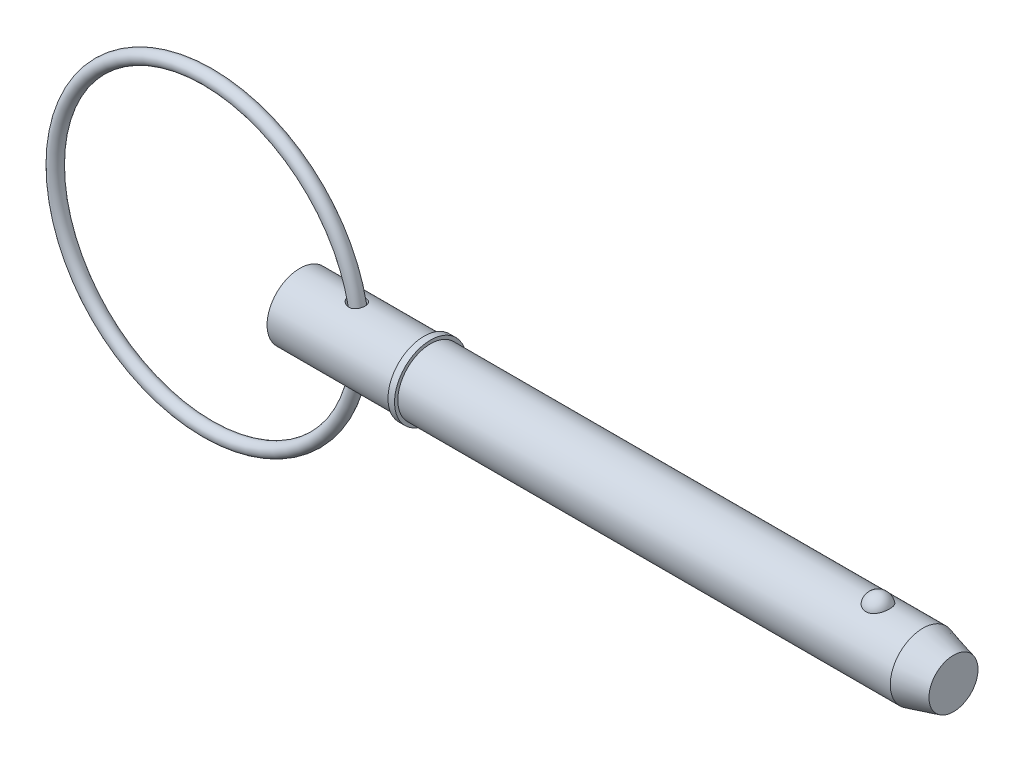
ISO-10303-21;
HEADER;
FILE_DESCRIPTION(('STEP AP214'),'2;1');
FILE_NAME('part.step','',(''),(''),'','','');
FILE_SCHEMA(('AUTOMOTIVE_DESIGN { 1 0 10303 214 1 1 1 1 }'));
ENDSEC;
DATA;
#1=APPLICATION_CONTEXT('core data for automotive mechanical design processes');
#2=APPLICATION_PROTOCOL_DEFINITION('international standard','automotive_design',2000,#1);
#3=PRODUCT_CONTEXT('',#1,'mechanical');
#4=PRODUCT('Part','Part','',(#3));
#5=PRODUCT_RELATED_PRODUCT_CATEGORY('part','',(#4));
#6=PRODUCT_DEFINITION_FORMATION('','',#4);
#7=PRODUCT_DEFINITION_CONTEXT('part definition',#1,'design');
#8=PRODUCT_DEFINITION('design','',#6,#7);
#9=PRODUCT_DEFINITION_SHAPE('','',#8);
#10=(LENGTH_UNIT() NAMED_UNIT(*) SI_UNIT(.MILLI.,.METRE.));
#11=(NAMED_UNIT(*) PLANE_ANGLE_UNIT() SI_UNIT($,.RADIAN.));
#12=(NAMED_UNIT(*) SI_UNIT($,.STERADIAN.) SOLID_ANGLE_UNIT());
#13=UNCERTAINTY_MEASURE_WITH_UNIT(LENGTH_MEASURE(1.E-05),#10,'distance_accuracy_value','');
#14=(GEOMETRIC_REPRESENTATION_CONTEXT(3) GLOBAL_UNCERTAINTY_ASSIGNED_CONTEXT((#13)) GLOBAL_UNIT_ASSIGNED_CONTEXT((#10,
#11,#12)) REPRESENTATION_CONTEXT('',''));
#15=CARTESIAN_POINT('',(0.,0.,0.));
#16=DIRECTION('',(0.,0.,1.));
#17=DIRECTION('',(1.,0.,0.));
#18=AXIS2_PLACEMENT_3D('',#15,#16,#17);
#19=CARTESIAN_POINT('',(-13.4013067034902,0.,0.));
#20=DIRECTION('',(0.,0.,1.));
#21=DIRECTION('',(1.,0.,0.));
#22=AXIS2_PLACEMENT_3D('',#19,#20,#21);
#23=TOROIDAL_SURFACE('',#22,22.225,0.952999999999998);
#24=CARTESIAN_POINT('',(9.77669329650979,0.,0.));
#25=VERTEX_POINT('',#24);
#26=VERTEX_LOOP('',#25);
#27=FACE_BOUND('',#26,.T.);
#28=ADVANCED_FACE('P0_F12',(#27),#23,.T.);
#29=CLOSED_SHELL('',(#28));
#30=MANIFOLD_SOLID_BREP('P0_B1',#29);
#31=CARTESIAN_POINT('',(0.,0.,0.));
#32=DIRECTION('',(1.,0.,0.));
#33=DIRECTION('',(0.,0.,-1.));
#34=AXIS2_PLACEMENT_3D('',#31,#32,#33);
#35=CYLINDRICAL_SURFACE('',#34,4.765);
#36=CARTESIAN_POINT('',(7.48459594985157,4.685973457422,-0.864220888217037));
#37=CARTESIAN_POINT('',(7.53849733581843,4.67711144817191,-0.912273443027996));
#38=CARTESIAN_POINT('',(7.59654891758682,4.66833039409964,-0.955745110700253));
#39=CARTESIAN_POINT('',(7.71924602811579,4.65195567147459,-1.03251233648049));
#40=CARTESIAN_POINT('',(7.78389917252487,4.64436340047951,-1.06579596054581));
#41=CARTESIAN_POINT('',(7.91808098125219,4.63129108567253,-1.12124172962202));
#42=CARTESIAN_POINT('',(7.98761280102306,4.62581242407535,-1.14339659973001));
#43=CARTESIAN_POINT('',(8.12956198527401,4.61771699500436,-1.17566870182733));
#44=CARTESIAN_POINT('',(8.20197774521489,4.61509865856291,-1.18579253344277));
#45=CARTESIAN_POINT('',(8.34550810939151,4.6131791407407,-1.19323853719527));
#46=CARTESIAN_POINT('',(8.41660306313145,4.61378793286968,-1.19090812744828));
#47=CARTESIAN_POINT('',(8.55721866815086,4.61812874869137,-1.17396277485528));
#48=CARTESIAN_POINT('',(8.62673979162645,4.62185982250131,-1.15935156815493));
#49=CARTESIAN_POINT('',(8.75801373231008,4.63172632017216,-1.11925454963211));
#50=CARTESIAN_POINT('',(8.81998342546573,4.63771186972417,-1.09443918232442));
#51=CARTESIAN_POINT('',(8.93863698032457,4.65140179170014,-1.03470792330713));
#52=CARTESIAN_POINT('',(8.99532131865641,4.65910600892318,-0.999792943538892));
#53=CARTESIAN_POINT('',(9.10080884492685,4.67519705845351,-0.921583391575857));
#54=CARTESIAN_POINT('',(9.14973848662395,4.68356861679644,-0.878455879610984));
#55=CARTESIAN_POINT('',(9.23971126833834,4.70019813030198,-0.784620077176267));
#56=CARTESIAN_POINT('',(9.28075401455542,4.7084560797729,-0.733911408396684));
#57=CARTESIAN_POINT('',(9.35441071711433,4.7240688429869,-0.62563775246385));
#58=CARTESIAN_POINT('',(9.38691359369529,4.73141115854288,-0.567995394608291));
#59=CARTESIAN_POINT('',(9.44203216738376,4.74427907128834,-0.447974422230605));
#60=CARTESIAN_POINT('',(9.46464743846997,4.74980459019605,-0.385595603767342));
#61=CARTESIAN_POINT('',(9.49961110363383,4.75848927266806,-0.257248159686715));
#62=CARTESIAN_POINT('',(9.51186382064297,4.76162635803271,-0.191251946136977));
#63=CARTESIAN_POINT('',(9.52545294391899,4.76511165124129,-0.0580729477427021));
#64=CARTESIAN_POINT('',(9.52678936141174,4.76545986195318,0.00910983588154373));
#65=CARTESIAN_POINT('',(9.51851557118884,4.76333054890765,0.142723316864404));
#66=CARTESIAN_POINT('',(9.50891008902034,4.76085424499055,0.209154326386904));
#67=CARTESIAN_POINT('',(9.47899306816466,4.75334441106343,0.339411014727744));
#68=CARTESIAN_POINT('',(9.45868126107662,4.74831081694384,0.403236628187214));
#69=CARTESIAN_POINT('',(9.4078294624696,4.73622777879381,0.526509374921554));
#70=CARTESIAN_POINT('',(9.37728413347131,4.72917728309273,0.585954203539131));
#71=CARTESIAN_POINT('',(9.30671117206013,4.71383320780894,0.698745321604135));
#72=CARTESIAN_POINT('',(9.26668347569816,4.70553961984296,0.752091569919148));
#73=CARTESIAN_POINT('',(9.17821531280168,4.68864637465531,0.851083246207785));
#74=CARTESIAN_POINT('',(9.12978756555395,4.68004719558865,0.896740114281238));
#75=CARTESIAN_POINT('',(9.02575872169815,4.66350833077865,0.97912505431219));
#76=CARTESIAN_POINT('',(8.97015856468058,4.65556855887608,1.01585429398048));
#77=CARTESIAN_POINT('',(8.85409306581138,4.6413534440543,1.0789347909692));
#78=CARTESIAN_POINT('',(8.79369898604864,4.63505812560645,1.10541268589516));
#79=CARTESIAN_POINT('',(8.66918290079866,4.62469916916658,1.1479836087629));
#80=CARTESIAN_POINT('',(8.60506121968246,4.62063533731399,1.1640775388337));
#81=CARTESIAN_POINT('',(8.47537782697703,4.61517348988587,1.18554696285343));
#82=CARTESIAN_POINT('',(8.4098281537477,4.61375835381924,1.19099130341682));
#83=CARTESIAN_POINT('',(8.2786938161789,4.61362908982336,1.19149080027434));
#84=CARTESIAN_POINT('',(8.21310914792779,4.61491539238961,1.18654430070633));
#85=CARTESIAN_POINT('',(8.08152457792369,4.62006017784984,1.16635311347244));
#86=CARTESIAN_POINT('',(8.01557748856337,4.62399895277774,1.15078675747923));
#87=CARTESIAN_POINT('',(7.88704537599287,4.63403793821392,1.10966738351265));
#88=CARTESIAN_POINT('',(7.82446148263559,4.64013886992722,1.08411103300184));
#89=CARTESIAN_POINT('',(7.70057947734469,4.65423592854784,1.02195168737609));
#90=CARTESIAN_POINT('',(7.63957197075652,4.66232221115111,0.984788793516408));
#91=CARTESIAN_POINT('',(7.52457021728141,4.67924552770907,0.900950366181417));
#92=CARTESIAN_POINT('',(7.47057819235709,4.68808279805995,0.854271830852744));
#93=CARTESIAN_POINT('',(7.37028930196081,4.70567913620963,0.751386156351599));
#94=CARTESIAN_POINT('',(7.32416327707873,4.7144333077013,0.695010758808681));
#95=CARTESIAN_POINT('',(7.24276674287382,4.73060166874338,0.574719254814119));
#96=CARTESIAN_POINT('',(7.20749051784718,4.73801656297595,0.510807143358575));
#97=CARTESIAN_POINT('',(7.15148495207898,4.75009927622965,0.381705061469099));
#98=CARTESIAN_POINT('',(7.12994463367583,4.7549169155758,0.31688231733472));
#99=CARTESIAN_POINT('',(7.09904467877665,4.76189692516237,0.184270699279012));
#100=CARTESIAN_POINT('',(7.08967554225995,4.76406136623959,0.116484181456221));
#101=CARTESIAN_POINT('',(7.08394150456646,4.76538257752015,-0.0133529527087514));
#102=CARTESIAN_POINT('',(7.0864533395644,4.76479916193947,-0.0753538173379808));
#103=CARTESIAN_POINT('',(7.10181380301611,4.76127985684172,-0.197993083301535));
#104=CARTESIAN_POINT('',(7.11466291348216,4.75834385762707,-0.258631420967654));
#105=CARTESIAN_POINT('',(7.14973937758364,4.75051877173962,-0.375744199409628));
#106=CARTESIAN_POINT('',(7.17178938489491,4.7456667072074,-0.432274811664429));
#107=CARTESIAN_POINT('',(7.22432962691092,4.73449674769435,-0.54107038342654));
#108=CARTESIAN_POINT('',(7.25481702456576,4.72817934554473,-0.593336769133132));
#109=CARTESIAN_POINT('',(7.31700895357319,4.71588241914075,-0.683642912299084));
#110=CARTESIAN_POINT('',(7.34750058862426,4.7100477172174,-0.722547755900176));
#111=CARTESIAN_POINT('',(7.41288050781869,4.69812059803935,-0.796421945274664));
#112=CARTESIAN_POINT('',(7.44776960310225,4.69202813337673,-0.831390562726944));
#113=CARTESIAN_POINT('',(7.48459594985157,4.685973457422,-0.864220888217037));
#114=B_SPLINE_CURVE_WITH_KNOTS('',3,(#36,#37,#38,#39,#40,#41,#42,#43,#44,#45,#46,#47,#48,#49,
#50,#51,#52,#53,#54,#55,#56,#57,#58,#59,#60,#61,#62,#63,#64,#65,#66,#67,#68,#69,#70,#71,#72,#73,
#74,#75,#76,#77,#78,#79,#80,#81,#82,#83,#84,#85,#86,#87,#88,#89,#90,#91,#92,#93,#94,#95,#96,#97,
#98,#99,#100,#101,#102,#103,#104,#105,#106,#107,#108,#109,#110,#111,#112,#113),.UNSPECIFIED.,
.T.,.F.,(4,2,2,2,2,2,2,2,2,2,2,2,2,2,2,2,2,2,2,2,2,2,2,2,2,2,2,2,2,2,2,2,2,2,2,2,2,2,4),(0.,
0.218078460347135,0.436411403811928,0.654886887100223,0.873242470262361,1.08553925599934,
1.2977714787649,1.49785367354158,1.6979178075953,1.8942789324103,2.09064985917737,
2.28946102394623,2.48828075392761,2.68891673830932,2.88955251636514,3.09010167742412,
3.29065586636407,3.49131482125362,3.69197512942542,3.89233421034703,4.09266707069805,
4.29043955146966,4.48819484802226,4.68466743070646,4.8811713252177,5.08390806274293,
5.28671248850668,5.50140943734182,5.71617422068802,5.93513249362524,6.15397522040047,
6.35827356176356,6.56241234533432,6.74765856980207,6.93291343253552,7.11475139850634,
7.29652829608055,7.44549570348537,7.59449062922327),.UNSPECIFIED.);
#115=CARTESIAN_POINT('',(7.48459594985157,4.685973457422,-0.864220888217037));
#116=VERTEX_POINT('',#115);
#117=EDGE_CURVE('P1_E42',#116,#116,#114,.T.);
#118=ORIENTED_EDGE('',*,*,#117,.T.);
#119=EDGE_LOOP('',(#118));
#120=FACE_BOUND('',#119,.T.);
#121=CARTESIAN_POINT('',(0.,0.,0.));
#122=DIRECTION('',(1.,0.,0.));
#123=DIRECTION('',(0.,0.,-1.));
#124=AXIS2_PLACEMENT_3D('',#121,#122,#123);
#125=CIRCLE('',#124,4.765);
#126=CARTESIAN_POINT('',(0.,0.,-4.765));
#127=VERTEX_POINT('',#126);
#128=EDGE_CURVE('P1_E9',#127,#127,#125,.T.);
#129=ORIENTED_EDGE('',*,*,#128,.T.);
#130=EDGE_LOOP('',(#129));
#131=FACE_BOUND('',#130,.T.);
#132=CARTESIAN_POINT('',(18.097,0.,0.));
#133=DIRECTION('',(1.,0.,0.));
#134=DIRECTION('',(0.,0.,-1.));
#135=AXIS2_PLACEMENT_3D('',#132,#133,#134);
#136=CIRCLE('',#135,4.765);
#137=CARTESIAN_POINT('',(18.097,0.,-4.765));
#138=VERTEX_POINT('',#137);
#139=EDGE_CURVE('P1_E25',#138,#138,#136,.T.);
#140=ORIENTED_EDGE('',*,*,#139,.F.);
#141=EDGE_LOOP('',(#140));
#142=FACE_BOUND('',#141,.T.);
#143=CARTESIAN_POINT('',(7.48459594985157,-4.685973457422,-0.864220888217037));
#144=CARTESIAN_POINT('',(7.43440944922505,-4.6942250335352,-0.819477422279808));
#145=CARTESIAN_POINT('',(7.38778663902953,-4.70255210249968,-0.77073361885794));
#146=CARTESIAN_POINT('',(7.3030968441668,-4.7184989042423,-0.666172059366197));
#147=CARTESIAN_POINT('',(7.26503010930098,-4.72611861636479,-0.610354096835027));
#148=CARTESIAN_POINT('',(7.19878266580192,-4.73983819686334,-0.492624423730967));
#149=CARTESIAN_POINT('',(7.17064194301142,-4.74593188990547,-0.430689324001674));
#150=CARTESIAN_POINT('',(7.12584349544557,-4.75581281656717,-0.3026233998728));
#151=CARTESIAN_POINT('',(7.10917889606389,-4.75960143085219,-0.236495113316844));
#152=CARTESIAN_POINT('',(7.0889853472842,-4.76421379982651,-0.106818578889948));
#153=CARTESIAN_POINT('',(7.0846333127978,-4.76522320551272,-0.0434047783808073));
#154=CARTESIAN_POINT('',(7.08693064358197,-4.7646936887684,0.0832041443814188));
#155=CARTESIAN_POINT('',(7.09357756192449,-4.76315533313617,0.146399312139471));
#156=CARTESIAN_POINT('',(7.11694629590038,-4.75784365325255,0.267709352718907));
#157=CARTESIAN_POINT('',(7.13318365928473,-4.75417793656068,0.325923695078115));
#158=CARTESIAN_POINT('',(7.17459606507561,-4.74508048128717,0.438922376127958));
#159=CARTESIAN_POINT('',(7.19977257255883,-4.73964845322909,0.493706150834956));
#160=CARTESIAN_POINT('',(7.25946789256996,-4.72725615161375,0.60111049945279));
#161=CARTESIAN_POINT('',(7.2943661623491,-4.72023663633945,0.653512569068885));
#162=CARTESIAN_POINT('',(7.37173226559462,-4.70550732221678,0.752279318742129));
#163=CARTESIAN_POINT('',(7.41420315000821,-4.69779724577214,0.798641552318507));
#164=CARTESIAN_POINT('',(7.50982312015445,-4.6816641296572,0.888551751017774));
#165=CARTESIAN_POINT('',(7.56359853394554,-4.67324162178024,0.931434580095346));
#166=CARTESIAN_POINT('',(7.67736628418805,-4.65728554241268,1.00819498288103));
#167=CARTESIAN_POINT('',(7.7373611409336,-4.64975233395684,1.04206888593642));
#168=CARTESIAN_POINT('',(7.86574076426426,-4.63599923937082,1.10169445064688));
#169=CARTESIAN_POINT('',(7.93441048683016,-4.62988111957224,1.12685968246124));
#170=CARTESIAN_POINT('',(8.07519000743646,-4.62035710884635,1.16529928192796));
#171=CARTESIAN_POINT('',(8.14729925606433,-4.61695078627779,1.1785755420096));
#172=CARTESIAN_POINT('',(8.29111621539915,-4.61341807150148,1.19232949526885));
#173=CARTESIAN_POINT('',(8.36279361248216,-4.61321655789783,1.19310032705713));
#174=CARTESIAN_POINT('',(8.50512944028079,-4.61602317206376,1.1821962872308));
#175=CARTESIAN_POINT('',(8.57578827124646,-4.61903000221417,1.17052644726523));
#176=CARTESIAN_POINT('',(8.70965757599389,-4.62766311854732,1.13589249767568));
#177=CARTESIAN_POINT('',(8.77306169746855,-4.63312492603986,1.11363308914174));
#178=CARTESIAN_POINT('',(8.8949702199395,-4.64598463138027,1.05869880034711));
#179=CARTESIAN_POINT('',(8.95347516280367,-4.65338231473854,1.02602507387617));
#180=CARTESIAN_POINT('',(9.06253415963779,-4.66906009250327,0.952097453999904));
#181=CARTESIAN_POINT('',(9.11324728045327,-4.67731427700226,0.911072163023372));
#182=CARTESIAN_POINT('',(9.20707850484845,-4.69393979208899,0.821122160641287));
#183=CARTESIAN_POINT('',(9.25019629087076,-4.70231112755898,0.772197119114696));
#184=CARTESIAN_POINT('',(9.32819072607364,-4.71835356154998,0.667239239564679));
#185=CARTESIAN_POINT('',(9.36297449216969,-4.72601623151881,0.611136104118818));
#186=CARTESIAN_POINT('',(9.42286382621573,-4.73971239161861,0.493799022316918));
#187=CARTESIAN_POINT('',(9.44796891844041,-4.74574580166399,0.432564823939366));
#188=CARTESIAN_POINT('',(9.48811605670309,-4.75559286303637,0.305990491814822));
#189=CARTESIAN_POINT('',(9.50304870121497,-4.75938232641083,0.240613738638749));
#190=CARTESIAN_POINT('',(9.5220569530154,-4.76423188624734,0.108201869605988));
#191=CARTESIAN_POINT('',(9.52613255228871,-4.76529198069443,0.0411667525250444));
#192=CARTESIAN_POINT('',(9.52332772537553,-4.76456884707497,-0.0926701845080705));
#193=CARTESIAN_POINT('',(9.51644541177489,-4.76278512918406,-0.159471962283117));
#194=CARTESIAN_POINT('',(9.49188827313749,-4.75656536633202,-0.290934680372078));
#195=CARTESIAN_POINT('',(9.47421322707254,-4.75212926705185,-0.355595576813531));
#196=CARTESIAN_POINT('',(9.42849503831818,-4.74108318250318,-0.480955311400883));
#197=CARTESIAN_POINT('',(9.4004503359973,-4.73447287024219,-0.541653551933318));
#198=CARTESIAN_POINT('',(9.33467290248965,-4.71979928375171,-0.657361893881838));
#199=CARTESIAN_POINT('',(9.29694000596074,-4.71173598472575,-0.712371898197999));
#200=CARTESIAN_POINT('',(9.2127449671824,-4.69505469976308,-0.815106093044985));
#201=CARTESIAN_POINT('',(9.1662875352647,-4.68643701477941,-0.862834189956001));
#202=CARTESIAN_POINT('',(9.06584125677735,-4.66961864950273,-0.949656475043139));
#203=CARTESIAN_POINT('',(9.01185326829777,-4.66141792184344,-0.98875164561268));
#204=CARTESIAN_POINT('',(8.8985010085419,-4.64646376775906,-1.0567894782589));
#205=CARTESIAN_POINT('',(8.83920621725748,-4.63969468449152,-1.08584444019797));
#206=CARTESIAN_POINT('',(8.71642097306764,-4.62824519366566,-1.13365785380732));
#207=CARTESIAN_POINT('',(8.65293102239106,-4.623564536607,-1.15241753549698));
#208=CARTESIAN_POINT('',(8.52421291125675,-4.61681938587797,-1.17914952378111));
#209=CARTESIAN_POINT('',(8.45900634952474,-4.6147310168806,-1.18722032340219));
#210=CARTESIAN_POINT('',(8.32811210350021,-4.61325848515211,-1.19292878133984));
#211=CARTESIAN_POINT('',(8.26242433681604,-4.61387479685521,-1.19056460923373));
#212=CARTESIAN_POINT('',(8.13057358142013,-4.6177227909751,-1.17555160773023));
#213=CARTESIAN_POINT('',(8.06444352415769,-4.62102282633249,-1.16263394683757));
#214=CARTESIAN_POINT('',(7.93513143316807,-4.62989870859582,-1.12676570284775));
#215=CARTESIAN_POINT('',(7.87194976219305,-4.6354748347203,-1.10381388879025));
#216=CARTESIAN_POINT('',(7.75155849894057,-4.64811746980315,-1.04928030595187));
#217=CARTESIAN_POINT('',(7.69423767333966,-4.65514232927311,-1.01793362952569));
#218=CARTESIAN_POINT('',(7.58503138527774,-4.67007903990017,-0.947046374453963));
#219=CARTESIAN_POINT('',(7.53314612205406,-4.67799092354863,-0.907505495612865));
#220=CARTESIAN_POINT('',(7.48459594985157,-4.685973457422,-0.864220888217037));
#221=B_SPLINE_CURVE_WITH_KNOTS('',3,(#143,#144,#145,#146,#147,#148,#149,#150,#151,#152,#153,
#154,#155,#156,#157,#158,#159,#160,#161,#162,#163,#164,#165,#166,#167,#168,#169,#170,#171,#172,
#173,#174,#175,#176,#177,#178,#179,#180,#181,#182,#183,#184,#185,#186,#187,#188,#189,#190,#191,
#192,#193,#194,#195,#196,#197,#198,#199,#200,#201,#202,#203,#204,#205,#206,#207,#208,#209,#210,
#211,#212,#213,#214,#215,#216,#217,#218,#219,#220),.UNSPECIFIED.,.T.,.F.,(4,2,2,2,2,2,2,2,2,2,2,
2,2,2,2,2,2,2,2,2,2,2,2,2,2,2,2,2,2,2,2,2,2,2,2,2,2,2,4),(0.,0.203013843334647,
0.406033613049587,0.609862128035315,0.813568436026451,1.0032929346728,1.19297523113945,
1.37380897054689,1.55467236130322,1.74393241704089,1.93326889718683,2.14025373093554,
2.3473227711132,2.566425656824,2.78549366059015,2.9994188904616,3.21325763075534,
3.41451842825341,3.61575693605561,3.81208930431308,4.00842987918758,4.20686629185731,
4.40531245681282,4.60586051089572,4.80640871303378,5.0069914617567,5.20757831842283,
5.40819535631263,5.60881581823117,5.80932827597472,6.00981790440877,6.2079863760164,
6.40613116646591,6.60243714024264,6.79877754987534,7.00028133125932,7.20180983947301,
7.39819723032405,7.59459181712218),.UNSPECIFIED.);
#222=CARTESIAN_POINT('',(7.48459594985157,-4.685973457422,-0.864220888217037));
#223=VERTEX_POINT('',#222);
#224=EDGE_CURVE('P1_E17',#223,#223,#221,.T.);
#225=ORIENTED_EDGE('',*,*,#224,.T.);
#226=EDGE_LOOP('',(#225));
#227=FACE_BOUND('',#226,.T.);
#228=ADVANCED_FACE('P1_F13',(#120,#131,#142,#227),#35,.T.);
#229=CARTESIAN_POINT('',(0.,0.,0.));
#230=DIRECTION('',(1.,0.,0.));
#231=DIRECTION('',(0.,0.,-1.));
#232=AXIS2_PLACEMENT_3D('',#229,#230,#231);
#233=CYLINDRICAL_SURFACE('',#232,4.765);
#234=CARTESIAN_POINT('',(90.8041944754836,0.,0.));
#235=DIRECTION('',(1.,0.,0.));
#236=DIRECTION('',(0.,0.,-1.));
#237=AXIS2_PLACEMENT_3D('',#234,#235,#236);
#238=CIRCLE('',#237,4.765);
#239=CARTESIAN_POINT('',(90.8041944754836,0.,-4.765));
#240=VERTEX_POINT('',#239);
#241=EDGE_CURVE('P1_E99',#240,#240,#238,.T.);
#242=ORIENTED_EDGE('',*,*,#241,.F.);
#243=EDGE_LOOP('',(#242));
#244=FACE_BOUND('',#243,.T.);
#245=CARTESIAN_POINT('',(19.05,0.,0.));
#246=DIRECTION('',(1.,0.,0.));
#247=DIRECTION('',(0.,0.,-1.));
#248=AXIS2_PLACEMENT_3D('',#245,#246,#247);
#249=CIRCLE('',#248,4.765);
#250=CARTESIAN_POINT('',(19.05,0.,-4.765));
#251=VERTEX_POINT('',#250);
#252=EDGE_CURVE('P1_E96',#251,#251,#249,.T.);
#253=ORIENTED_EDGE('',*,*,#252,.T.);
#254=EDGE_LOOP('',(#253));
#255=FACE_BOUND('',#254,.T.);
#256=CARTESIAN_POINT('',(84.2510202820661,4.42764777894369,1.76101111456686));
#257=CARTESIAN_POINT('',(84.1597212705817,4.42764470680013,1.76101422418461));
#258=CARTESIAN_POINT('',(84.0684468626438,4.4305909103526,1.75366340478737));
#259=CARTESIAN_POINT('',(83.8886154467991,4.44201846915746,1.72451180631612));
#260=CARTESIAN_POINT('',(83.8000577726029,4.45049845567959,1.702714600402));
#261=CARTESIAN_POINT('',(83.6282570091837,4.47200516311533,1.64539370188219));
#262=CARTESIAN_POINT('',(83.5450064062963,4.48502527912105,1.60988994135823));
#263=CARTESIAN_POINT('',(83.3857633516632,4.51419542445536,1.52617873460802));
#264=CARTESIAN_POINT('',(83.3097723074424,4.53034605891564,1.47796883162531));
#265=CARTESIAN_POINT('',(83.1647445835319,4.5645931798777,1.36860494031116));
#266=CARTESIAN_POINT('',(83.0959645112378,4.58273170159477,1.30712420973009));
#267=CARTESIAN_POINT('',(82.9693423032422,4.61870302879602,1.17370204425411));
#268=CARTESIAN_POINT('',(82.9115021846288,4.63653577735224,1.10175868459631));
#269=CARTESIAN_POINT('',(82.805570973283,4.67090140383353,0.945806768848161));
#270=CARTESIAN_POINT('',(82.7580305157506,4.68734068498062,0.861402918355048));
#271=CARTESIAN_POINT('',(82.6770817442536,4.71628466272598,0.685442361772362));
#272=CARTESIAN_POINT('',(82.6436747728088,4.72878898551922,0.593884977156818));
#273=CARTESIAN_POINT('',(82.591287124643,4.74874061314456,0.404781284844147));
#274=CARTESIAN_POINT('',(82.5725178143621,4.75611366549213,0.307168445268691));
#275=CARTESIAN_POINT('',(82.5505846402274,4.76475393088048,0.109940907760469));
#276=CARTESIAN_POINT('',(82.5474205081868,4.76602124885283,0.0103262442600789));
#277=CARTESIAN_POINT('',(82.5567405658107,4.76232928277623,-0.187629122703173));
#278=CARTESIAN_POINT('',(82.5691588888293,4.7573962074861,-0.285973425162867));
#279=CARTESIAN_POINT('',(82.6092804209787,4.74184975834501,-0.479027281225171));
#280=CARTESIAN_POINT('',(82.6369839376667,4.7312362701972,-0.573736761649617));
#281=CARTESIAN_POINT('',(82.7071581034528,4.70540026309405,-0.756973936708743));
#282=CARTESIAN_POINT('',(82.7496460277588,4.69017235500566,-0.845494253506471));
#283=CARTESIAN_POINT('',(82.848520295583,4.65669867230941,-1.01378033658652));
#284=CARTESIAN_POINT('',(82.9049076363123,4.63845268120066,-1.09354547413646));
#285=CARTESIAN_POINT('',(83.030552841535,4.60085438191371,-1.24228523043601));
#286=CARTESIAN_POINT('',(83.0998439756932,4.58149930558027,-1.31123108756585));
#287=CARTESIAN_POINT('',(83.2496066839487,4.54391653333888,-1.43607409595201));
#288=CARTESIAN_POINT('',(83.3300771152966,4.52568872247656,-1.49197257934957));
#289=CARTESIAN_POINT('',(83.4981500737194,4.49293007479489,-1.58786764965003));
#290=CARTESIAN_POINT('',(83.5855445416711,4.47832346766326,-1.62820219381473));
#291=CARTESIAN_POINT('',(83.766553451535,4.45406011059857,-1.6934575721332));
#292=CARTESIAN_POINT('',(83.8601655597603,4.44440151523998,-1.71838415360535));
#293=CARTESIAN_POINT('',(84.0458939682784,4.43159888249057,-1.7511284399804));
#294=CARTESIAN_POINT('',(84.137849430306,4.42815213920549,-1.75974223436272));
#295=CARTESIAN_POINT('',(84.3219658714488,4.42724735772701,-1.76201865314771));
#296=CARTESIAN_POINT('',(84.4141268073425,4.42978816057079,-1.75568417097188));
#297=CARTESIAN_POINT('',(84.5931292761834,4.4403864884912,-1.72869560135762));
#298=CARTESIAN_POINT('',(84.6800474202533,4.44827555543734,-1.7084785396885));
#299=CARTESIAN_POINT('',(84.8491314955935,4.46852246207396,-1.65479562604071));
#300=CARTESIAN_POINT('',(84.9312970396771,4.4808806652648,-1.62132869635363));
#301=CARTESIAN_POINT('',(85.0905916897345,4.50907357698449,-1.54120560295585));
#302=CARTESIAN_POINT('',(85.1675700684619,4.52497884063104,-1.49427526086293));
#303=CARTESIAN_POINT('',(85.3127080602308,4.55845148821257,-1.38881222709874));
#304=CARTESIAN_POINT('',(85.3808656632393,4.57601924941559,-1.33027689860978));
#305=CARTESIAN_POINT('',(85.5100990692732,4.61196537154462,-1.19991049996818));
#306=CARTESIAN_POINT('',(85.5706562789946,4.63034074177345,-1.12756415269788));
#307=CARTESIAN_POINT('',(85.6792797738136,4.66513959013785,-0.973612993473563));
#308=CARTESIAN_POINT('',(85.7273438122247,4.68156271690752,-0.892006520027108));
#309=CARTESIAN_POINT('',(85.811383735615,4.71130224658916,-0.718892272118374));
#310=CARTESIAN_POINT('',(85.8469185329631,4.724501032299,-0.627149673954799));
#311=CARTESIAN_POINT('',(85.9029522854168,4.74571823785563,-0.438611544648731));
#312=CARTESIAN_POINT('',(85.923450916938,4.75373654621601,-0.341815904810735));
#313=CARTESIAN_POINT('',(85.9490338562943,4.76378905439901,-0.145633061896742));
#314=CARTESIAN_POINT('',(85.954076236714,4.76580697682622,-0.0462395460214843));
#315=CARTESIAN_POINT('',(85.9485239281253,4.7636057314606,0.152038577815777));
#316=CARTESIAN_POINT('',(85.9379294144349,4.75938663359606,0.250923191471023));
#317=CARTESIAN_POINT('',(85.9013875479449,4.74516937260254,0.445004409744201));
#318=CARTESIAN_POINT('',(85.8754964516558,4.73519238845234,0.540213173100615));
#319=CARTESIAN_POINT('',(85.8089273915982,4.71049394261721,0.724662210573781));
#320=CARTESIAN_POINT('',(85.768248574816,4.69577220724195,0.813902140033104));
#321=CARTESIAN_POINT('',(85.6727177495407,4.66303767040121,0.984313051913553));
#322=CARTESIAN_POINT('',(85.6178042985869,4.64501070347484,1.06544688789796));
#323=CARTESIAN_POINT('',(85.4950496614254,4.60764678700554,1.21692673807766));
#324=CARTESIAN_POINT('',(85.4272086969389,4.58830985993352,1.28727293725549));
#325=CARTESIAN_POINT('',(85.2805480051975,4.55060370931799,1.41479271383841));
#326=CARTESIAN_POINT('',(85.2017918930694,4.53222967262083,1.47203785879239));
#327=CARTESIAN_POINT('',(85.0349890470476,4.49849576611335,1.57212016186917));
#328=CARTESIAN_POINT('',(84.9469417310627,4.48313608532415,1.61495641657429));
#329=CARTESIAN_POINT('',(84.7597918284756,4.45676184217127,1.68642657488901));
#330=CARTESIAN_POINT('',(84.6603653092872,4.44598302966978,1.71430590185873));
#331=CARTESIAN_POINT('',(84.4576210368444,4.43142918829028,1.75159258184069));
#332=CARTESIAN_POINT('',(84.3543049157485,4.42765125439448,1.76100759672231));
#333=CARTESIAN_POINT('',(84.2510202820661,4.42764777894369,1.76101111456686));
#334=B_SPLINE_CURVE_WITH_KNOTS('',3,(#256,#257,#258,#259,#260,#261,#262,#263,#264,#265,#266,
#267,#268,#269,#270,#271,#272,#273,#274,#275,#276,#277,#278,#279,#280,#281,#282,#283,#284,#285,
#286,#287,#288,#289,#290,#291,#292,#293,#294,#295,#296,#297,#298,#299,#300,#301,#302,#303,#304,
#305,#306,#307,#308,#309,#310,#311,#312,#313,#314,#315,#316,#317,#318,#319,#320,#321,#322,#323,
#324,#325,#326,#327,#328,#329,#330,#331,#332,#333),.UNSPECIFIED.,.T.,.F.,(4,2,2,2,2,2,2,2,2,2,2,
2,2,2,2,2,2,2,2,2,2,2,2,2,2,2,2,2,2,2,2,2,2,2,2,2,2,2,4),(0.,0.273517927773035,
0.546968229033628,0.820022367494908,1.09312934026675,1.37393946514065,1.65480131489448,
1.94820420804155,2.24163496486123,2.53922817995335,2.83681628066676,3.13315071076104,
3.42949110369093,3.7261789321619,4.02288805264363,4.3203730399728,4.61782764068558,
4.90840095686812,5.19886582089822,5.47474855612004,5.75057789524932,6.0180997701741,
6.28564340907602,6.5590778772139,6.83257454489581,7.11962987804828,7.40673679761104,
7.70312663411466,7.99952284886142,8.29672237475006,8.5939185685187,8.89002850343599,
9.18615552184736,9.48358266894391,9.78100471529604,10.0767610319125,10.3725358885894,
10.6820893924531,10.9915144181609),.UNSPECIFIED.);
#335=CARTESIAN_POINT('',(84.2510202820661,4.42764777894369,1.76101111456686));
#336=VERTEX_POINT('',#335);
#337=EDGE_CURVE('P1_E34',#336,#336,#334,.T.);
#338=ORIENTED_EDGE('',*,*,#337,.T.);
#339=EDGE_LOOP('',(#338));
#340=FACE_BOUND('',#339,.T.);
#341=ADVANCED_FACE('P1_F46',(#244,#255,#340),#233,.T.);
#342=CARTESIAN_POINT('',(0.,0.,0.));
#343=DIRECTION('',(-1.,0.,0.));
#344=DIRECTION('',(0.,0.,1.));
#345=AXIS2_PLACEMENT_3D('',#342,#343,#344);
#346=PLANE('',#345);
#347=ORIENTED_EDGE('',*,*,#128,.F.);
#348=EDGE_LOOP('',(#347));
#349=FACE_BOUND('',#348,.T.);
#350=ADVANCED_FACE('P1_F15',(#349),#346,.T.);
#351=CARTESIAN_POINT('',(18.097,4.765,0.));
#352=DIRECTION('',(-1.,0.,0.));
#353=DIRECTION('',(0.,0.,1.));
#354=AXIS2_PLACEMENT_3D('',#351,#352,#353);
#355=PLANE('',#354);
#356=ORIENTED_EDGE('',*,*,#139,.T.);
#357=EDGE_LOOP('',(#356));
#358=FACE_BOUND('',#357,.T.);
#359=CARTESIAN_POINT('',(18.097,0.,0.));
#360=DIRECTION('',(1.,0.,0.));
#361=DIRECTION('',(0.,0.,-1.));
#362=AXIS2_PLACEMENT_3D('',#359,#360,#361);
#363=CIRCLE('',#362,5.2415);
#364=CARTESIAN_POINT('',(18.097,0.,-5.2415));
#365=VERTEX_POINT('',#364);
#366=EDGE_CURVE('P1_E30',#365,#365,#363,.T.);
#367=ORIENTED_EDGE('',*,*,#366,.F.);
#368=EDGE_LOOP('',(#367));
#369=FACE_BOUND('',#368,.T.);
#370=ADVANCED_FACE('P1_F81',(#358,#369),#355,.T.);
#371=CARTESIAN_POINT('',(0.,0.,0.));
#372=DIRECTION('',(1.,0.,0.));
#373=DIRECTION('',(0.,0.,-1.));
#374=AXIS2_PLACEMENT_3D('',#371,#372,#373);
#375=CYLINDRICAL_SURFACE('',#374,5.2415);
#376=ORIENTED_EDGE('',*,*,#366,.T.);
#377=EDGE_LOOP('',(#376));
#378=FACE_BOUND('',#377,.T.);
#379=CARTESIAN_POINT('',(19.05,0.,0.));
#380=DIRECTION('',(1.,0.,0.));
#381=DIRECTION('',(0.,0.,-1.));
#382=AXIS2_PLACEMENT_3D('',#379,#380,#381);
#383=CIRCLE('',#382,5.2415);
#384=CARTESIAN_POINT('',(19.05,0.,-5.2415));
#385=VERTEX_POINT('',#384);
#386=EDGE_CURVE('P1_E95',#385,#385,#383,.T.);
#387=ORIENTED_EDGE('',*,*,#386,.F.);
#388=EDGE_LOOP('',(#387));
#389=FACE_BOUND('',#388,.T.);
#390=ADVANCED_FACE('P1_F68',(#378,#389),#375,.T.);
#391=CARTESIAN_POINT('',(19.05,5.2415,0.));
#392=DIRECTION('',(1.,0.,0.));
#393=DIRECTION('',(0.,0.,-1.));
#394=AXIS2_PLACEMENT_3D('',#391,#392,#393);
#395=PLANE('',#394);
#396=ORIENTED_EDGE('',*,*,#386,.T.);
#397=EDGE_LOOP('',(#396));
#398=FACE_BOUND('',#397,.T.);
#399=ORIENTED_EDGE('',*,*,#252,.F.);
#400=EDGE_LOOP('',(#399));
#401=FACE_BOUND('',#400,.T.);
#402=ADVANCED_FACE('P1_F62',(#398,#401),#395,.T.);
#403=CARTESIAN_POINT('',(95.25,0.,0.));
#404=DIRECTION('',(-1.,0.,0.));
#405=DIRECTION('',(0.,0.,1.));
#406=AXIS2_PLACEMENT_3D('',#403,#404,#405);
#407=CONICAL_SURFACE('',#406,3.57375000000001,0.26179938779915);
#408=ORIENTED_EDGE('',*,*,#241,.T.);
#409=EDGE_LOOP('',(#408));
#410=FACE_BOUND('',#409,.T.);
#411=CARTESIAN_POINT('',(95.25,0.,0.));
#412=DIRECTION('',(1.,0.,0.));
#413=DIRECTION('',(0.,0.,-1.));
#414=AXIS2_PLACEMENT_3D('',#411,#412,#413);
#415=CIRCLE('',#414,3.57375000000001);
#416=CARTESIAN_POINT('',(95.25,0.,-3.57375000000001));
#417=VERTEX_POINT('',#416);
#418=EDGE_CURVE('P1_E41',#417,#417,#415,.T.);
#419=ORIENTED_EDGE('',*,*,#418,.F.);
#420=EDGE_LOOP('',(#419));
#421=FACE_BOUND('',#420,.T.);
#422=ADVANCED_FACE('P1_F59',(#410,#421),#407,.T.);
#423=CARTESIAN_POINT('',(95.25,3.57375000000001,0.));
#424=DIRECTION('',(1.,0.,0.));
#425=DIRECTION('',(0.,0.,-1.));
#426=AXIS2_PLACEMENT_3D('',#423,#424,#425);
#427=PLANE('',#426);
#428=ORIENTED_EDGE('',*,*,#418,.T.);
#429=EDGE_LOOP('',(#428));
#430=FACE_BOUND('',#429,.T.);
#431=ADVANCED_FACE('P1_F55',(#430),#427,.T.);
#432=CARTESIAN_POINT('',(84.2510202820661,4.28849999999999,0.));
#433=DIRECTION('',(-1.,0.,0.));
#434=DIRECTION('',(0.,-1.,0.));
#435=AXIS2_PLACEMENT_3D('',#432,#433,#434);
#436=SPHERICAL_SURFACE('',#435,1.76649999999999);
#437=ORIENTED_EDGE('',*,*,#337,.F.);
#438=EDGE_LOOP('',(#437));
#439=FACE_BOUND('',#438,.T.);
#440=ADVANCED_FACE('P1_F50',(#439),#436,.T.);
#441=CARTESIAN_POINT('',(-13.4013067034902,0.,0.));
#442=DIRECTION('',(0.,0.,1.));
#443=DIRECTION('',(1.,0.,0.));
#444=AXIS2_PLACEMENT_3D('',#441,#442,#443);
#445=TOROIDAL_SURFACE('',#444,22.225,1.19125);
#446=ORIENTED_EDGE('',*,*,#224,.F.);
#447=EDGE_LOOP('',(#446));
#448=FACE_BOUND('',#447,.T.);
#449=ORIENTED_EDGE('',*,*,#117,.F.);
#450=EDGE_LOOP('',(#449));
#451=FACE_BOUND('',#450,.T.);
#452=ADVANCED_FACE('P1_F54',(#448,#451),#445,.F.);
#453=CLOSED_SHELL('',(#228,#341,#350,#370,#390,#402,#422,#431,#440,#452));
#454=MANIFOLD_SOLID_BREP('P1_B1',#453);
#455=ADVANCED_BREP_SHAPE_REPRESENTATION('',(#18,#30,#454),#14);
#456=SHAPE_DEFINITION_REPRESENTATION(#9,#455);
ENDSEC;
END-ISO-10303-21;
